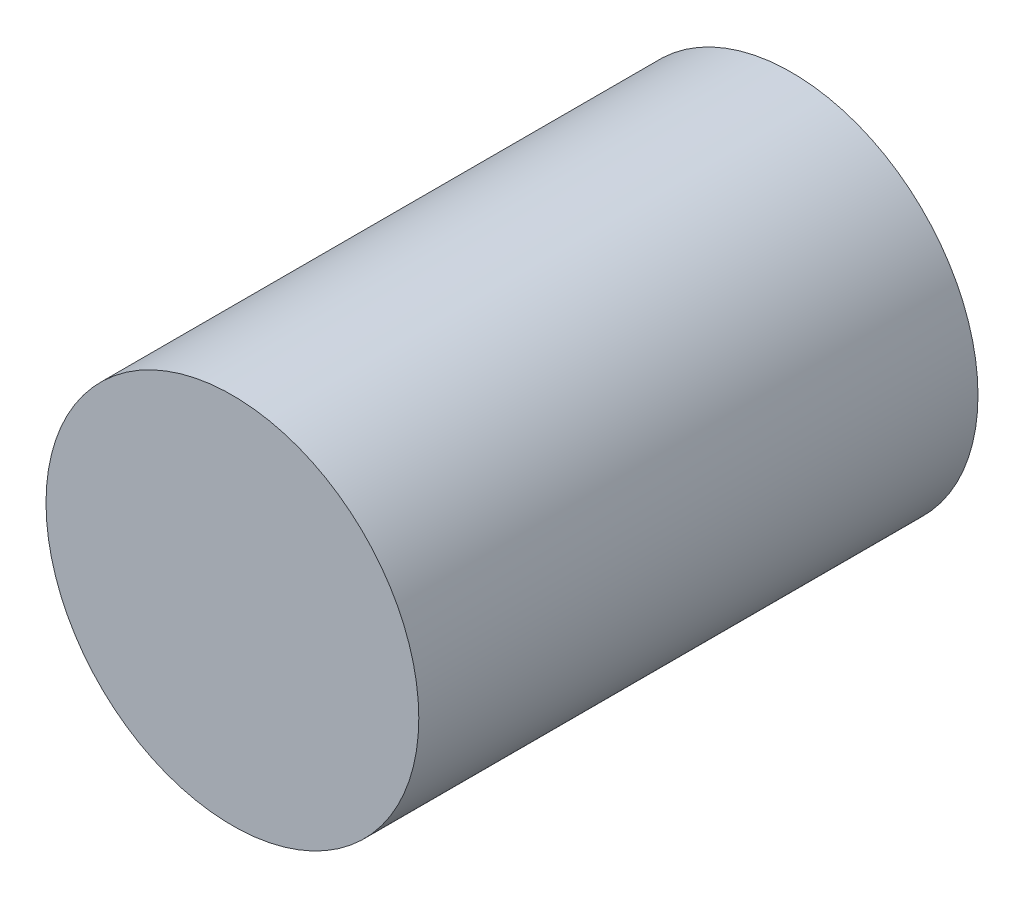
from build123d import *

# Parameters (mm, degrees)
SKETCH2_R           = 5.08
BOSS_EXTRUDE1_DEPTH = 15.24


with BuildPart() as part:
    # Sketch2 → Boss-Extrude1 (new body)
    with BuildSketch(Plane.XY):
        with Locations(Location((0, 0, 0), (0, 0, 180))):
            Circle(SKETCH2_R)
    extrude(amount=BOSS_EXTRUDE1_DEPTH)


solid = part.part
